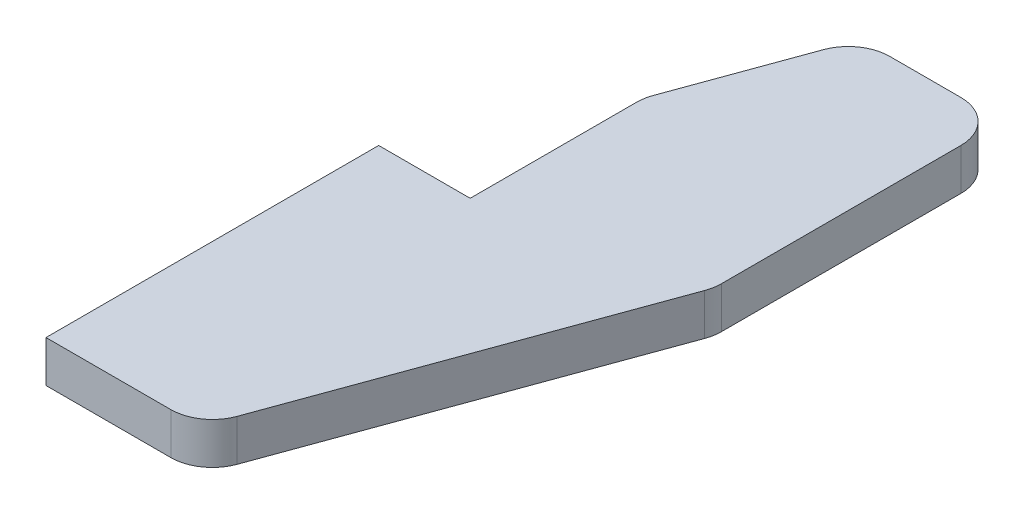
from build123d import *

# Parameters (mm, degrees)
BOSS_EXTRU_1_DEPTH = 5


with BuildPart() as part:
    # Esquisse1 → Boss.-Extru.1 (new body)
    with BuildSketch(Plane(origin=(0, 2.5, 0), x_dir=(1, 0, 0), z_dir=(0, 1, 0))):
        with BuildLine():
            Line((11, 0), (0, 0))
            Line((0, 0), (0, -40))
            Line((0, -40), (15, -40))
            ThreePointArc((15, -40), (17.867882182, -39.095760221), (19.698463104, -36.710100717))
            Line((19.698463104, -36.710100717), (34.698463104, 4.502060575))
            ThreePointArc((34.698463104, 4.502060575), (34.924038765, 5.343920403), (35, 6.212161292))
            Line((35, 6.212161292), (35, 35))
            ThreePointArc((35, 35), (33.535533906, 38.535533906), (30, 40))
            Line((30, 40), (21.459553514, 40))
            ThreePointArc((21.459553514, 40), (18.591671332, 39.095760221), (16.76109041, 36.710100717))
            Line((16.76109041, 36.710100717), (11.301536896, 21.710100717))
            ThreePointArc((11.301536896, 21.710100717), (11.075961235, 20.868240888), (11, 20))
            Line((11, 20), (11, 0))
        make_face()
    extrude(amount=-BOSS_EXTRU_1_DEPTH)


solid = part.part
